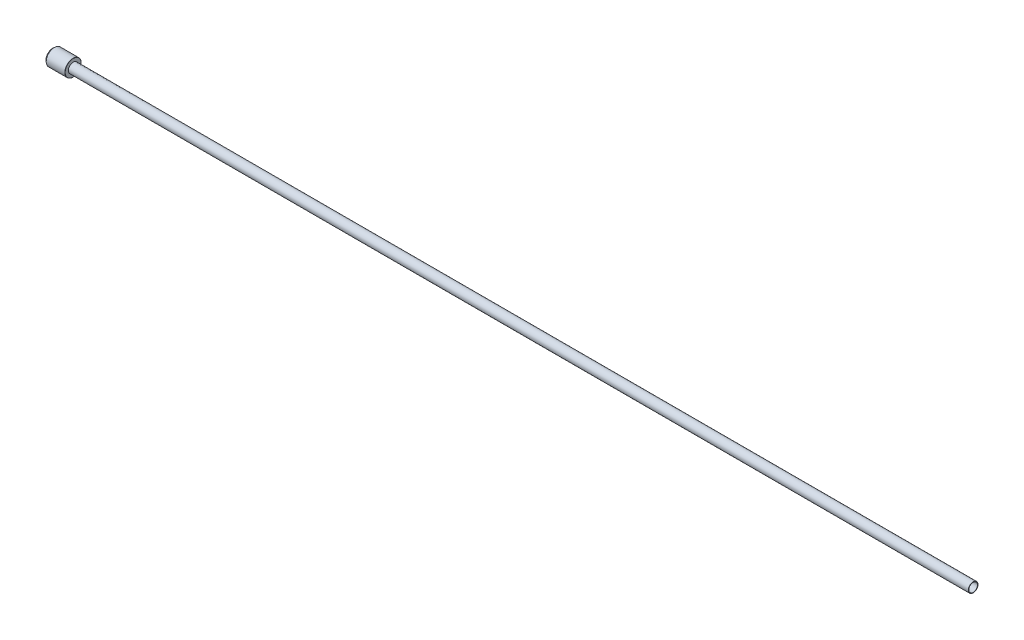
ISO-10303-21;
HEADER;
FILE_DESCRIPTION(('STEP AP214'),'2;1');
FILE_NAME('part.step','',(''),(''),'','','');
FILE_SCHEMA(('AUTOMOTIVE_DESIGN { 1 0 10303 214 1 1 1 1 }'));
ENDSEC;
DATA;
#1=APPLICATION_CONTEXT('core data for automotive mechanical design processes');
#2=APPLICATION_PROTOCOL_DEFINITION('international standard','automotive_design',2000,#1);
#3=PRODUCT_CONTEXT('',#1,'mechanical');
#4=PRODUCT('Part','Part','',(#3));
#5=PRODUCT_RELATED_PRODUCT_CATEGORY('part','',(#4));
#6=PRODUCT_DEFINITION_FORMATION('','',#4);
#7=PRODUCT_DEFINITION_CONTEXT('part definition',#1,'design');
#8=PRODUCT_DEFINITION('design','',#6,#7);
#9=PRODUCT_DEFINITION_SHAPE('','',#8);
#10=(LENGTH_UNIT() NAMED_UNIT(*) SI_UNIT(.MILLI.,.METRE.));
#11=(NAMED_UNIT(*) PLANE_ANGLE_UNIT() SI_UNIT($,.RADIAN.));
#12=(NAMED_UNIT(*) SI_UNIT($,.STERADIAN.) SOLID_ANGLE_UNIT());
#13=UNCERTAINTY_MEASURE_WITH_UNIT(LENGTH_MEASURE(1.E-05),#10,'distance_accuracy_value','');
#14=(GEOMETRIC_REPRESENTATION_CONTEXT(3) GLOBAL_UNCERTAINTY_ASSIGNED_CONTEXT((#13)) GLOBAL_UNIT_ASSIGNED_CONTEXT((#10,
#11,#12)) REPRESENTATION_CONTEXT('',''));
#15=CARTESIAN_POINT('',(0.,0.,0.));
#16=DIRECTION('',(0.,0.,1.));
#17=DIRECTION('',(1.,0.,0.));
#18=AXIS2_PLACEMENT_3D('',#15,#16,#17);
#19=CARTESIAN_POINT('',(10.,4.,0.));
#20=DIRECTION('',(-1.,0.,0.));
#21=DIRECTION('',(0.,0.,1.));
#22=AXIS2_PLACEMENT_3D('',#19,#20,#21);
#23=PLANE('',#22);
#24=CARTESIAN_POINT('',(10.,0.,0.));
#25=DIRECTION('',(-1.,0.,0.));
#26=DIRECTION('',(0.,0.,1.));
#27=AXIS2_PLACEMENT_3D('',#24,#25,#26);
#28=CIRCLE('',#27,3.9);
#29=CARTESIAN_POINT('',(10.,0.,3.9));
#30=VERTEX_POINT('',#29);
#31=EDGE_CURVE('E10',#30,#30,#28,.F.);
#32=ORIENTED_EDGE('',*,*,#31,.T.);
#33=EDGE_LOOP('',(#32));
#34=FACE_BOUND('',#33,.T.);
#35=CARTESIAN_POINT('',(10.,0.,0.));
#36=DIRECTION('',(-1.,0.,0.));
#37=DIRECTION('',(0.,0.,1.));
#38=AXIS2_PLACEMENT_3D('',#35,#36,#37);
#39=CIRCLE('',#38,2.3749);
#40=CARTESIAN_POINT('',(10.,0.,2.3749));
#41=VERTEX_POINT('',#40);
#42=EDGE_CURVE('E63',#41,#41,#39,.T.);
#43=ORIENTED_EDGE('',*,*,#42,.T.);
#44=EDGE_LOOP('',(#43));
#45=FACE_BOUND('',#44,.T.);
#46=ADVANCED_FACE('F31',(#34,#45),#23,.F.);
#47=CARTESIAN_POINT('',(-22.2121854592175,0.,0.));
#48=DIRECTION('',(-1.,0.,0.));
#49=DIRECTION('',(0.,0.,1.));
#50=AXIS2_PLACEMENT_3D('',#47,#48,#49);
#51=CYLINDRICAL_SURFACE('',#50,4.);
#52=CARTESIAN_POINT('',(9.9,0.,0.));
#53=DIRECTION('',(-1.,0.,0.));
#54=DIRECTION('',(0.,0.,1.));
#55=AXIS2_PLACEMENT_3D('',#52,#53,#54);
#56=CIRCLE('',#55,4.);
#57=CARTESIAN_POINT('',(9.9,0.,4.));
#58=VERTEX_POINT('',#57);
#59=EDGE_CURVE('E38',#58,#58,#56,.T.);
#60=ORIENTED_EDGE('',*,*,#59,.T.);
#61=EDGE_LOOP('',(#60));
#62=FACE_BOUND('',#61,.T.);
#63=CARTESIAN_POINT('',(0.804499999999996,0.,0.));
#64=DIRECTION('',(-1.,0.,0.));
#65=DIRECTION('',(0.,0.,1.));
#66=AXIS2_PLACEMENT_3D('',#63,#64,#65);
#67=CIRCLE('',#66,4.);
#68=CARTESIAN_POINT('',(0.804499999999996,0.,4.));
#69=VERTEX_POINT('',#68);
#70=EDGE_CURVE('E42',#69,#69,#67,.T.);
#71=ORIENTED_EDGE('',*,*,#70,.F.);
#72=EDGE_LOOP('',(#71));
#73=FACE_BOUND('',#72,.T.);
#74=ADVANCED_FACE('F101',(#62,#73),#51,.T.);
#75=CARTESIAN_POINT('',(0.804499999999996,0.,0.));
#76=DIRECTION('',(1.,0.,0.));
#77=DIRECTION('',(0.,0.,-1.));
#78=AXIS2_PLACEMENT_3D('',#75,#76,#77);
#79=CONICAL_SURFACE('',#78,4.,0.78539816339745);
#80=CARTESIAN_POINT('',(0.0999999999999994,0.,0.));
#81=DIRECTION('',(-1.,0.,0.));
#82=DIRECTION('',(0.,0.,1.));
#83=AXIS2_PLACEMENT_3D('',#80,#81,#82);
#84=CIRCLE('',#83,3.2955);
#85=CARTESIAN_POINT('',(0.0999999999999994,0.,3.2955));
#86=VERTEX_POINT('',#85);
#87=EDGE_CURVE('E46',#86,#86,#84,.T.);
#88=ORIENTED_EDGE('',*,*,#87,.F.);
#89=EDGE_LOOP('',(#88));
#90=FACE_BOUND('',#89,.T.);
#91=ORIENTED_EDGE('',*,*,#70,.T.);
#92=EDGE_LOOP('',(#91));
#93=FACE_BOUND('',#92,.T.);
#94=ADVANCED_FACE('F95',(#90,#93),#79,.T.);
#95=CARTESIAN_POINT('',(-22.2121854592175,0.,0.));
#96=DIRECTION('',(-1.,0.,0.));
#97=DIRECTION('',(0.,0.,1.));
#98=AXIS2_PLACEMENT_3D('',#95,#96,#97);
#99=CYLINDRICAL_SURFACE('',#98,3.2955);
#100=CARTESIAN_POINT('',(0.,0.,0.));
#101=DIRECTION('',(-1.,0.,0.));
#102=DIRECTION('',(0.,0.,1.));
#103=AXIS2_PLACEMENT_3D('',#100,#101,#102);
#104=CIRCLE('',#103,3.2955);
#105=CARTESIAN_POINT('',(0.,0.,3.2955));
#106=VERTEX_POINT('',#105);
#107=EDGE_CURVE('E51',#106,#106,#104,.T.);
#108=ORIENTED_EDGE('',*,*,#107,.F.);
#109=EDGE_LOOP('',(#108));
#110=FACE_BOUND('',#109,.T.);
#111=ORIENTED_EDGE('',*,*,#87,.T.);
#112=EDGE_LOOP('',(#111));
#113=FACE_BOUND('',#112,.T.);
#114=ADVANCED_FACE('F89',(#110,#113),#99,.T.);
#115=CARTESIAN_POINT('',(0.,2.1209,0.));
#116=DIRECTION('',(1.,0.,0.));
#117=DIRECTION('',(0.,0.,-1.));
#118=AXIS2_PLACEMENT_3D('',#115,#116,#117);
#119=PLANE('',#118);
#120=CARTESIAN_POINT('',(0.,0.,0.));
#121=DIRECTION('',(-1.,0.,0.));
#122=DIRECTION('',(0.,0.,1.));
#123=AXIS2_PLACEMENT_3D('',#120,#121,#122);
#124=CIRCLE('',#123,2.1209);
#125=CARTESIAN_POINT('',(0.,0.,2.1209));
#126=VERTEX_POINT('',#125);
#127=EDGE_CURVE('E54',#126,#126,#124,.T.);
#128=ORIENTED_EDGE('',*,*,#127,.F.);
#129=EDGE_LOOP('',(#128));
#130=FACE_BOUND('',#129,.T.);
#131=ORIENTED_EDGE('',*,*,#107,.T.);
#132=EDGE_LOOP('',(#131));
#133=FACE_BOUND('',#132,.T.);
#134=ADVANCED_FACE('F83',(#130,#133),#119,.F.);
#135=CARTESIAN_POINT('',(-22.2121854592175,0.,0.));
#136=DIRECTION('',(-1.,0.,0.));
#137=DIRECTION('',(0.,0.,1.));
#138=AXIS2_PLACEMENT_3D('',#135,#136,#137);
#139=CYLINDRICAL_SURFACE('',#138,2.12090000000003);
#140=CARTESIAN_POINT('',(450.,0.,0.));
#141=DIRECTION('',(-1.,0.,0.));
#142=DIRECTION('',(0.,0.,1.));
#143=AXIS2_PLACEMENT_3D('',#140,#141,#142);
#144=CIRCLE('',#143,2.12090000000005);
#145=CARTESIAN_POINT('',(450.,0.,2.12090000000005));
#146=VERTEX_POINT('',#145);
#147=EDGE_CURVE('E57',#146,#146,#144,.T.);
#148=ORIENTED_EDGE('',*,*,#147,.F.);
#149=EDGE_LOOP('',(#148));
#150=FACE_BOUND('',#149,.T.);
#151=ORIENTED_EDGE('',*,*,#127,.T.);
#152=EDGE_LOOP('',(#151));
#153=FACE_BOUND('',#152,.T.);
#154=ADVANCED_FACE('F77',(#150,#153),#139,.F.);
#155=CARTESIAN_POINT('',(450.,2.3749,0.));
#156=DIRECTION('',(-1.,0.,0.));
#157=DIRECTION('',(0.,0.,1.));
#158=AXIS2_PLACEMENT_3D('',#155,#156,#157);
#159=PLANE('',#158);
#160=CARTESIAN_POINT('',(450.,0.,0.));
#161=DIRECTION('',(-1.,0.,0.));
#162=DIRECTION('',(0.,0.,1.));
#163=AXIS2_PLACEMENT_3D('',#160,#161,#162);
#164=CIRCLE('',#163,2.3749);
#165=CARTESIAN_POINT('',(450.,0.,2.3749));
#166=VERTEX_POINT('',#165);
#167=EDGE_CURVE('E60',#166,#166,#164,.T.);
#168=ORIENTED_EDGE('',*,*,#167,.F.);
#169=EDGE_LOOP('',(#168));
#170=FACE_BOUND('',#169,.T.);
#171=ORIENTED_EDGE('',*,*,#147,.T.);
#172=EDGE_LOOP('',(#171));
#173=FACE_BOUND('',#172,.T.);
#174=ADVANCED_FACE('F71',(#170,#173),#159,.F.);
#175=CARTESIAN_POINT('',(-22.2121854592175,0.,0.));
#176=DIRECTION('',(-1.,0.,0.));
#177=DIRECTION('',(0.,0.,1.));
#178=AXIS2_PLACEMENT_3D('',#175,#176,#177);
#179=CYLINDRICAL_SURFACE('',#178,2.3749);
#180=ORIENTED_EDGE('',*,*,#42,.F.);
#181=EDGE_LOOP('',(#180));
#182=FACE_BOUND('',#181,.T.);
#183=ORIENTED_EDGE('',*,*,#167,.T.);
#184=EDGE_LOOP('',(#183));
#185=FACE_BOUND('',#184,.T.);
#186=ADVANCED_FACE('F68',(#182,#185),#179,.T.);
#187=CARTESIAN_POINT('',(9.9,0.,0.));
#188=DIRECTION('',(-1.,0.,0.));
#189=DIRECTION('',(0.,0.,1.));
#190=AXIS2_PLACEMENT_3D('',#187,#188,#189);
#191=TOROIDAL_SURFACE('',#190,3.9,0.1);
#192=ORIENTED_EDGE('',*,*,#31,.F.);
#193=EDGE_LOOP('',(#192));
#194=FACE_BOUND('',#193,.T.);
#195=ORIENTED_EDGE('',*,*,#59,.F.);
#196=EDGE_LOOP('',(#195));
#197=FACE_BOUND('',#196,.T.);
#198=ADVANCED_FACE('F33',(#194,#197),#191,.T.);
#199=CLOSED_SHELL('',(#46,#74,#94,#114,#134,#154,#174,#186,#198));
#200=MANIFOLD_SOLID_BREP('B2',#199);
#201=ADVANCED_BREP_SHAPE_REPRESENTATION('',(#18,#200),#14);
#202=SHAPE_DEFINITION_REPRESENTATION(#9,#201);
ENDSEC;
END-ISO-10303-21;
